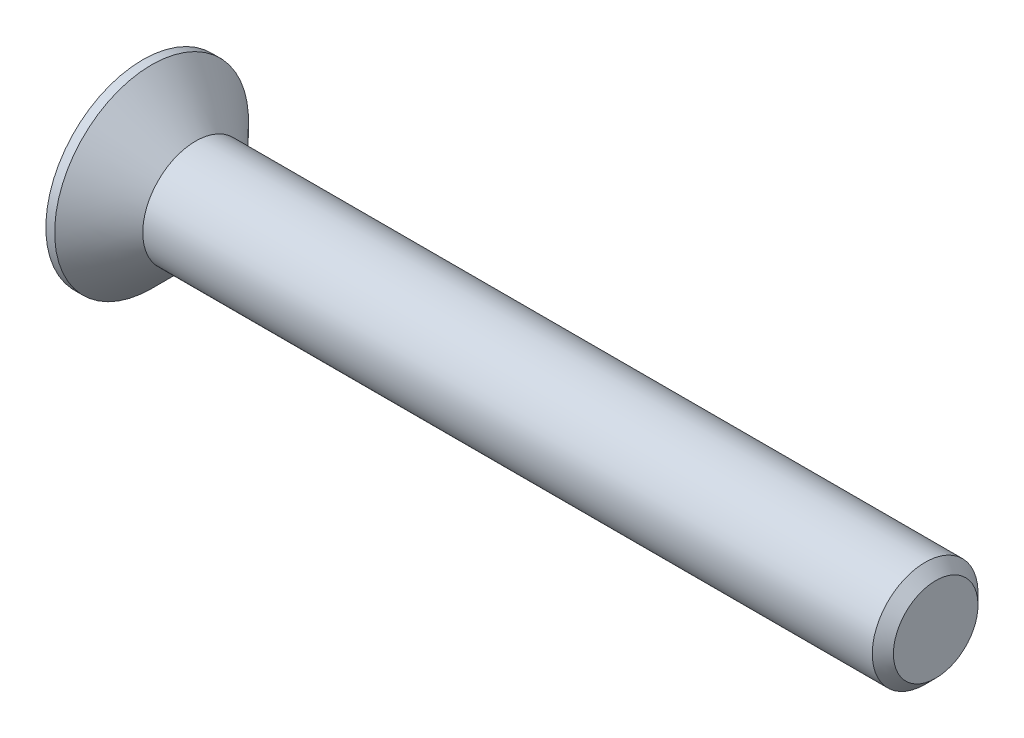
from build123d import *

# Parameters (mm, degrees)
CHAMFER1_SIZE      = 0.6
CUT_EXTRUDE1_DEPTH = 2.5


with BuildPart() as part:
    # Sketch1 → Revolve1 (revolve)
    with BuildSketch(Plane.XY, mode=Mode.PRIVATE) as revolve1_sk:
        Polygon((-3, 5.5), (-3, 0), (42, 0), (42, 3), (0, 3), (-2.5, 5.5), align=None)
    revolve(revolve1_sk.sketch.rotate(Axis((-3, 0, 0), (1, 0, 0)), 180), axis=Axis((-3, 0, 0), (1, 0, 0)))

    # Chamfer1
    chamfer1_edges = [part.edges().sort_by_distance(p)[0] for p in [
        (42, 3, 0),
    ]]
    chamfer(chamfer1_edges, length=CHAMFER1_SIZE)

    # Sketch2 → Cut-Extrude1 (cut)
    with BuildSketch(Plane.ZY.offset(3)):
        Polygon((-0.825, 3.3), (0.825, 3.3), (0.825, 0.825), (3.3, 0.825), (3.3, -0.825), (0.825, -0.825), (0.825, -3.3), (-0.825, -3.3), (-0.825, -0.825), (-3.3, -0.825), (-3.3, 0.825), (-0.825, 0.825), align=None)
    extrude(amount=-CUT_EXTRUDE1_DEPTH, mode=Mode.SUBTRACT)


solid = part.part
